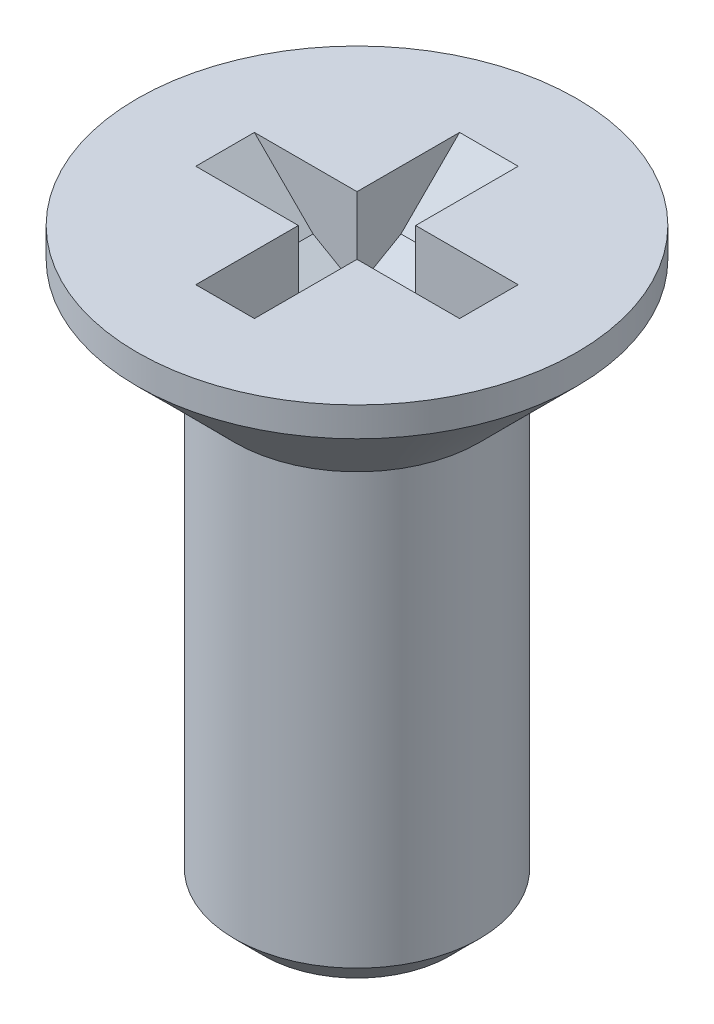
ISO-10303-21;
HEADER;
FILE_DESCRIPTION(('STEP AP214'),'2;1');
FILE_NAME('part.step','',(''),(''),'','','');
FILE_SCHEMA(('AUTOMOTIVE_DESIGN { 1 0 10303 214 1 1 1 1 }'));
ENDSEC;
DATA;
#1=APPLICATION_CONTEXT('core data for automotive mechanical design processes');
#2=APPLICATION_PROTOCOL_DEFINITION('international standard','automotive_design',2000,#1);
#3=PRODUCT_CONTEXT('',#1,'mechanical');
#4=PRODUCT('Part','Part','',(#3));
#5=PRODUCT_RELATED_PRODUCT_CATEGORY('part','',(#4));
#6=PRODUCT_DEFINITION_FORMATION('','',#4);
#7=PRODUCT_DEFINITION_CONTEXT('part definition',#1,'design');
#8=PRODUCT_DEFINITION('design','',#6,#7);
#9=PRODUCT_DEFINITION_SHAPE('','',#8);
#10=(LENGTH_UNIT() NAMED_UNIT(*) SI_UNIT(.MILLI.,.METRE.));
#11=(NAMED_UNIT(*) PLANE_ANGLE_UNIT() SI_UNIT($,.RADIAN.));
#12=(NAMED_UNIT(*) SI_UNIT($,.STERADIAN.) SOLID_ANGLE_UNIT());
#13=UNCERTAINTY_MEASURE_WITH_UNIT(LENGTH_MEASURE(1.E-05),#10,'distance_accuracy_value','');
#14=(GEOMETRIC_REPRESENTATION_CONTEXT(3) GLOBAL_UNCERTAINTY_ASSIGNED_CONTEXT((#13)) GLOBAL_UNIT_ASSIGNED_CONTEXT((#10,
#11,#12)) REPRESENTATION_CONTEXT('',''));
#15=CARTESIAN_POINT('',(0.,0.,0.));
#16=DIRECTION('',(0.,0.,1.));
#17=DIRECTION('',(1.,0.,0.));
#18=AXIS2_PLACEMENT_3D('',#15,#16,#17);
#19=CARTESIAN_POINT('',(-0.3,-0.8598076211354,-0.3));
#20=DIRECTION('',(0.,-1.,0.));
#21=DIRECTION('',(0.,0.,-1.));
#22=AXIS2_PLACEMENT_3D('',#19,#20,#21);
#23=PLANE('',#22);
#24=DIRECTION('',(1.,0.,0.));
#25=VECTOR('',#24,1.);
#26=CARTESIAN_POINT('',(0.3,-0.859807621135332,-0.300000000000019));
#27=LINE('',#26,#25);
#28=CARTESIAN_POINT('',(0.300000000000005,-0.859807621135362,-0.300000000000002));
#29=VERTEX_POINT('',#28);
#30=CARTESIAN_POINT('',(-0.300000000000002,-0.859807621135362,-0.300000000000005));
#31=VERTEX_POINT('',#30);
#32=EDGE_CURVE('E135',#29,#31,#27,.F.);
#33=ORIENTED_EDGE('',*,*,#32,.T.);
#34=DIRECTION('',(0.,0.,1.));
#35=VECTOR('',#34,1.);
#36=CARTESIAN_POINT('',(-0.300000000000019,-0.859807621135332,-0.3));
#37=LINE('',#36,#35);
#38=CARTESIAN_POINT('',(-0.300000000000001,-0.85980762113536,0.300000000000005));
#39=VERTEX_POINT('',#38);
#40=EDGE_CURVE('E116',#31,#39,#37,.T.);
#41=ORIENTED_EDGE('',*,*,#40,.T.);
#42=DIRECTION('',(1.,0.,0.));
#43=VECTOR('',#42,1.);
#44=CARTESIAN_POINT('',(-0.3,-0.859807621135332,0.300000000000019));
#45=LINE('',#44,#43);
#46=CARTESIAN_POINT('',(0.300000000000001,-0.85980762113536,0.300000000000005));
#47=VERTEX_POINT('',#46);
#48=EDGE_CURVE('E112',#39,#47,#45,.T.);
#49=ORIENTED_EDGE('',*,*,#48,.T.);
#50=DIRECTION('',(0.,0.,1.));
#51=VECTOR('',#50,1.);
#52=CARTESIAN_POINT('',(0.300000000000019,-0.859807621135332,0.3));
#53=LINE('',#52,#51);
#54=EDGE_CURVE('E137',#47,#29,#53,.F.);
#55=ORIENTED_EDGE('',*,*,#54,.T.);
#56=EDGE_LOOP('',(#33,#41,#49,#55));
#57=FACE_BOUND('',#56,.T.);
#58=ADVANCED_FACE('F17',(#57),#23,.F.);
#59=CARTESIAN_POINT('',(-0.3,-0.6,0.75));
#60=DIRECTION('',(0.,-0.866025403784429,0.500000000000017));
#61=DIRECTION('',(0.,-0.500000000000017,-0.866025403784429));
#62=AXIS2_PLACEMENT_3D('',#59,#60,#61);
#63=PLANE('',#62);
#64=DIRECTION('',(0.,-0.499999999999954,-0.866025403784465));
#65=VECTOR('',#64,1.);
#66=CARTESIAN_POINT('',(0.3,-0.6,0.75));
#67=LINE('',#66,#65);
#68=CARTESIAN_POINT('',(0.3,-0.6,0.75));
#69=VERTEX_POINT('',#68);
#70=EDGE_CURVE('E130',#69,#47,#67,.T.);
#71=ORIENTED_EDGE('',*,*,#70,.T.);
#72=ORIENTED_EDGE('',*,*,#48,.F.);
#73=DIRECTION('',(0.,-0.499999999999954,-0.866025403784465));
#74=VECTOR('',#73,1.);
#75=CARTESIAN_POINT('',(-0.3,-0.6,0.75));
#76=LINE('',#75,#74);
#77=CARTESIAN_POINT('',(-0.3,-0.6,0.75));
#78=VERTEX_POINT('',#77);
#79=EDGE_CURVE('E109',#78,#39,#76,.T.);
#80=ORIENTED_EDGE('',*,*,#79,.F.);
#81=DIRECTION('',(1.,0.,0.));
#82=VECTOR('',#81,1.);
#83=CARTESIAN_POINT('',(-0.3,-0.6,0.75));
#84=LINE('',#83,#82);
#85=EDGE_CURVE('E105',#78,#69,#84,.T.);
#86=ORIENTED_EDGE('',*,*,#85,.T.);
#87=EDGE_LOOP('',(#71,#72,#80,#86));
#88=FACE_BOUND('',#87,.T.);
#89=ADVANCED_FACE('F111',(#88),#63,.F.);
#90=CARTESIAN_POINT('',(0.75,-0.6,0.3));
#91=DIRECTION('',(0.500000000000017,-0.866025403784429,0.));
#92=DIRECTION('',(0.866025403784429,0.500000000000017,0.));
#93=AXIS2_PLACEMENT_3D('',#90,#91,#92);
#94=PLANE('',#93);
#95=DIRECTION('',(-0.866025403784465,-0.499999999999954,0.));
#96=VECTOR('',#95,1.);
#97=CARTESIAN_POINT('',(0.75,-0.6,-0.3));
#98=LINE('',#97,#96);
#99=CARTESIAN_POINT('',(0.75,-0.6,-0.3));
#100=VERTEX_POINT('',#99);
#101=EDGE_CURVE('E424',#100,#29,#98,.T.);
#102=ORIENTED_EDGE('',*,*,#101,.T.);
#103=ORIENTED_EDGE('',*,*,#54,.F.);
#104=DIRECTION('',(0.866025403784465,0.499999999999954,0.));
#105=VECTOR('',#104,1.);
#106=CARTESIAN_POINT('',(0.3,-0.8598076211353,0.3));
#107=LINE('',#106,#105);
#108=CARTESIAN_POINT('',(0.75,-0.6,0.3));
#109=VERTEX_POINT('',#108);
#110=EDGE_CURVE('E434',#47,#109,#107,.T.);
#111=ORIENTED_EDGE('',*,*,#110,.T.);
#112=DIRECTION('',(0.,0.,1.));
#113=VECTOR('',#112,1.);
#114=CARTESIAN_POINT('',(0.75,-0.6,0.3));
#115=LINE('',#114,#113);
#116=EDGE_CURVE('E429',#109,#100,#115,.F.);
#117=ORIENTED_EDGE('',*,*,#116,.T.);
#118=EDGE_LOOP('',(#102,#103,#111,#117));
#119=FACE_BOUND('',#118,.T.);
#120=ADVANCED_FACE('F339',(#119),#94,.F.);
#121=CARTESIAN_POINT('',(0.3,-0.6,-0.75));
#122=DIRECTION('',(0.,-0.866025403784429,-0.500000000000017));
#123=DIRECTION('',(0.,0.500000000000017,-0.866025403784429));
#124=AXIS2_PLACEMENT_3D('',#121,#122,#123);
#125=PLANE('',#124);
#126=DIRECTION('',(0.,-0.499999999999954,0.866025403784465));
#127=VECTOR('',#126,1.);
#128=CARTESIAN_POINT('',(-0.3,-0.6,-0.75));
#129=LINE('',#128,#127);
#130=CARTESIAN_POINT('',(-0.3,-0.6,-0.75));
#131=VERTEX_POINT('',#130);
#132=EDGE_CURVE('E388',#131,#31,#129,.T.);
#133=ORIENTED_EDGE('',*,*,#132,.T.);
#134=ORIENTED_EDGE('',*,*,#32,.F.);
#135=DIRECTION('',(0.,-0.499999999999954,0.866025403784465));
#136=VECTOR('',#135,1.);
#137=CARTESIAN_POINT('',(0.3,-0.6,-0.75));
#138=LINE('',#137,#136);
#139=CARTESIAN_POINT('',(0.3,-0.6,-0.75));
#140=VERTEX_POINT('',#139);
#141=EDGE_CURVE('E421',#140,#29,#138,.T.);
#142=ORIENTED_EDGE('',*,*,#141,.F.);
#143=DIRECTION('',(1.,0.,0.));
#144=VECTOR('',#143,1.);
#145=CARTESIAN_POINT('',(0.3,-0.6,-0.75));
#146=LINE('',#145,#144);
#147=EDGE_CURVE('E390',#140,#131,#146,.F.);
#148=ORIENTED_EDGE('',*,*,#147,.T.);
#149=EDGE_LOOP('',(#133,#134,#142,#148));
#150=FACE_BOUND('',#149,.T.);
#151=ADVANCED_FACE('F330',(#150),#125,.F.);
#152=CARTESIAN_POINT('',(-0.75,-0.6,-0.3));
#153=DIRECTION('',(-0.500000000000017,-0.866025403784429,0.));
#154=DIRECTION('',(0.866025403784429,-0.500000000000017,0.));
#155=AXIS2_PLACEMENT_3D('',#152,#153,#154);
#156=PLANE('',#155);
#157=DIRECTION('',(0.866025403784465,-0.499999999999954,0.));
#158=VECTOR('',#157,1.);
#159=CARTESIAN_POINT('',(-0.75,-0.6,-0.3));
#160=LINE('',#159,#158);
#161=CARTESIAN_POINT('',(-0.75,-0.6,-0.3));
#162=VERTEX_POINT('',#161);
#163=EDGE_CURVE('E394',#162,#31,#160,.T.);
#164=ORIENTED_EDGE('',*,*,#163,.F.);
#165=DIRECTION('',(0.,0.,1.));
#166=VECTOR('',#165,1.);
#167=CARTESIAN_POINT('',(-0.75,-0.6,-0.3));
#168=LINE('',#167,#166);
#169=CARTESIAN_POINT('',(-0.75,-0.6,0.3));
#170=VERTEX_POINT('',#169);
#171=EDGE_CURVE('E477',#162,#170,#168,.T.);
#172=ORIENTED_EDGE('',*,*,#171,.T.);
#173=DIRECTION('',(0.866025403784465,-0.499999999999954,0.));
#174=VECTOR('',#173,1.);
#175=CARTESIAN_POINT('',(-0.75,-0.6,0.3));
#176=LINE('',#175,#174);
#177=EDGE_CURVE('E400',#170,#39,#176,.T.);
#178=ORIENTED_EDGE('',*,*,#177,.T.);
#179=ORIENTED_EDGE('',*,*,#40,.F.);
#180=EDGE_LOOP('',(#164,#172,#178,#179));
#181=FACE_BOUND('',#180,.T.);
#182=ADVANCED_FACE('F322',(#181),#156,.F.);
#183=CARTESIAN_POINT('',(-0.3,0.,0.));
#184=DIRECTION('',(1.,0.,0.));
#185=DIRECTION('',(0.,0.,-1.));
#186=AXIS2_PLACEMENT_3D('',#183,#184,#185);
#187=PLANE('',#186);
#188=DIRECTION('',(0.,1.,0.));
#189=VECTOR('',#188,1.);
#190=CARTESIAN_POINT('',(-0.3,0.,0.3));
#191=LINE('',#190,#189);
#192=CARTESIAN_POINT('',(-0.3,0.,0.3));
#193=VERTEX_POINT('',#192);
#194=EDGE_CURVE('E475',#39,#193,#191,.T.);
#195=ORIENTED_EDGE('',*,*,#194,.T.);
#196=DIRECTION('',(0.,0.,-1.));
#197=VECTOR('',#196,1.);
#198=CARTESIAN_POINT('',(-0.3,0.,0.));
#199=LINE('',#198,#197);
#200=CARTESIAN_POINT('',(-0.3,0.,1.35));
#201=VERTEX_POINT('',#200);
#202=EDGE_CURVE('E121',#193,#201,#199,.F.);
#203=ORIENTED_EDGE('',*,*,#202,.T.);
#204=DIRECTION('',(0.,-0.707106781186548,-0.707106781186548));
#205=VECTOR('',#204,1.);
#206=CARTESIAN_POINT('',(-0.3,0.,1.35));
#207=LINE('',#206,#205);
#208=EDGE_CURVE('E115',#201,#78,#207,.T.);
#209=ORIENTED_EDGE('',*,*,#208,.T.);
#210=ORIENTED_EDGE('',*,*,#79,.T.);
#211=EDGE_LOOP('',(#195,#203,#209,#210));
#212=FACE_BOUND('',#211,.T.);
#213=ADVANCED_FACE('F119',(#212),#187,.T.);
#214=CARTESIAN_POINT('',(-0.3,0.,1.35));
#215=DIRECTION('',(0.,-0.707106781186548,0.707106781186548));
#216=DIRECTION('',(0.,-0.707106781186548,-0.707106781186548));
#217=AXIS2_PLACEMENT_3D('',#214,#215,#216);
#218=PLANE('',#217);
#219=ORIENTED_EDGE('',*,*,#85,.F.);
#220=ORIENTED_EDGE('',*,*,#208,.F.);
#221=DIRECTION('',(1.,0.,0.));
#222=VECTOR('',#221,1.);
#223=CARTESIAN_POINT('',(0.,0.,1.35));
#224=LINE('',#223,#222);
#225=CARTESIAN_POINT('',(0.3,0.,1.35));
#226=VERTEX_POINT('',#225);
#227=EDGE_CURVE('E469',#201,#226,#224,.T.);
#228=ORIENTED_EDGE('',*,*,#227,.T.);
#229=DIRECTION('',(0.,-0.707106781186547,-0.707106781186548));
#230=VECTOR('',#229,1.);
#231=CARTESIAN_POINT('',(0.3,0.,1.35));
#232=LINE('',#231,#230);
#233=EDGE_CURVE('E127',#226,#69,#232,.T.);
#234=ORIENTED_EDGE('',*,*,#233,.T.);
#235=EDGE_LOOP('',(#219,#220,#228,#234));
#236=FACE_BOUND('',#235,.T.);
#237=ADVANCED_FACE('F125',(#236),#218,.F.);
#238=CARTESIAN_POINT('',(0.3,0.,0.));
#239=DIRECTION('',(1.,0.,0.));
#240=DIRECTION('',(0.,0.,-1.));
#241=AXIS2_PLACEMENT_3D('',#238,#239,#240);
#242=PLANE('',#241);
#243=ORIENTED_EDGE('',*,*,#70,.F.);
#244=ORIENTED_EDGE('',*,*,#233,.F.);
#245=DIRECTION('',(0.,0.,-1.));
#246=VECTOR('',#245,1.);
#247=CARTESIAN_POINT('',(0.3,0.,0.));
#248=LINE('',#247,#246);
#249=CARTESIAN_POINT('',(0.3,0.,0.3));
#250=VERTEX_POINT('',#249);
#251=EDGE_CURVE('E440',#226,#250,#248,.T.);
#252=ORIENTED_EDGE('',*,*,#251,.T.);
#253=DIRECTION('',(0.,1.,0.));
#254=VECTOR('',#253,1.);
#255=CARTESIAN_POINT('',(0.3,0.,0.3));
#256=LINE('',#255,#254);
#257=EDGE_CURVE('E436',#250,#47,#256,.F.);
#258=ORIENTED_EDGE('',*,*,#257,.T.);
#259=EDGE_LOOP('',(#243,#244,#252,#258));
#260=FACE_BOUND('',#259,.T.);
#261=ADVANCED_FACE('F298',(#260),#242,.F.);
#262=CARTESIAN_POINT('',(0.,0.,0.3));
#263=DIRECTION('',(0.,0.,1.));
#264=DIRECTION('',(1.,0.,0.));
#265=AXIS2_PLACEMENT_3D('',#262,#263,#264);
#266=PLANE('',#265);
#267=DIRECTION('',(0.707106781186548,0.707106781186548,0.));
#268=VECTOR('',#267,1.);
#269=CARTESIAN_POINT('',(1.35,0.,0.3));
#270=LINE('',#269,#268);
#271=CARTESIAN_POINT('',(1.35,0.,0.3));
#272=VERTEX_POINT('',#271);
#273=EDGE_CURVE('E431',#272,#109,#270,.F.);
#274=ORIENTED_EDGE('',*,*,#273,.T.);
#275=ORIENTED_EDGE('',*,*,#110,.F.);
#276=ORIENTED_EDGE('',*,*,#257,.F.);
#277=DIRECTION('',(1.,0.,0.));
#278=VECTOR('',#277,1.);
#279=CARTESIAN_POINT('',(0.,0.,0.3));
#280=LINE('',#279,#278);
#281=EDGE_CURVE('E446',#250,#272,#280,.T.);
#282=ORIENTED_EDGE('',*,*,#281,.T.);
#283=EDGE_LOOP('',(#274,#275,#276,#282));
#284=FACE_BOUND('',#283,.T.);
#285=ADVANCED_FACE('F289',(#284),#266,.F.);
#286=CARTESIAN_POINT('',(1.35,0.,0.3));
#287=DIRECTION('',(0.707106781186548,-0.707106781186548,0.));
#288=DIRECTION('',(0.707106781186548,0.707106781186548,0.));
#289=AXIS2_PLACEMENT_3D('',#286,#287,#288);
#290=PLANE('',#289);
#291=ORIENTED_EDGE('',*,*,#116,.F.);
#292=ORIENTED_EDGE('',*,*,#273,.F.);
#293=DIRECTION('',(0.,0.,-1.));
#294=VECTOR('',#293,1.);
#295=CARTESIAN_POINT('',(1.35,0.,0.));
#296=LINE('',#295,#294);
#297=CARTESIAN_POINT('',(1.35,0.,-0.3));
#298=VERTEX_POINT('',#297);
#299=EDGE_CURVE('E449',#272,#298,#296,.T.);
#300=ORIENTED_EDGE('',*,*,#299,.T.);
#301=DIRECTION('',(-0.707106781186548,-0.707106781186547,0.));
#302=VECTOR('',#301,1.);
#303=CARTESIAN_POINT('',(1.35,0.,-0.3));
#304=LINE('',#303,#302);
#305=EDGE_CURVE('E426',#298,#100,#304,.T.);
#306=ORIENTED_EDGE('',*,*,#305,.T.);
#307=EDGE_LOOP('',(#291,#292,#300,#306));
#308=FACE_BOUND('',#307,.T.);
#309=ADVANCED_FACE('F280',(#308),#290,.F.);
#310=CARTESIAN_POINT('',(0.,0.,-0.3));
#311=DIRECTION('',(0.,0.,-1.));
#312=DIRECTION('',(-1.,0.,0.));
#313=AXIS2_PLACEMENT_3D('',#310,#311,#312);
#314=PLANE('',#313);
#315=ORIENTED_EDGE('',*,*,#101,.F.);
#316=ORIENTED_EDGE('',*,*,#305,.F.);
#317=DIRECTION('',(1.,0.,0.));
#318=VECTOR('',#317,1.);
#319=CARTESIAN_POINT('',(0.,0.,-0.3));
#320=LINE('',#319,#318);
#321=CARTESIAN_POINT('',(0.3,0.,-0.3));
#322=VERTEX_POINT('',#321);
#323=EDGE_CURVE('E451',#298,#322,#320,.F.);
#324=ORIENTED_EDGE('',*,*,#323,.T.);
#325=DIRECTION('',(0.,1.,0.));
#326=VECTOR('',#325,1.);
#327=CARTESIAN_POINT('',(0.3,0.,-0.3));
#328=LINE('',#327,#326);
#329=EDGE_CURVE('E418',#29,#322,#328,.T.);
#330=ORIENTED_EDGE('',*,*,#329,.F.);
#331=EDGE_LOOP('',(#315,#316,#324,#330));
#332=FACE_BOUND('',#331,.T.);
#333=ADVANCED_FACE('F271',(#332),#314,.F.);
#334=CARTESIAN_POINT('',(0.3,0.,0.));
#335=DIRECTION('',(-1.,0.,0.));
#336=DIRECTION('',(0.,0.,1.));
#337=AXIS2_PLACEMENT_3D('',#334,#335,#336);
#338=PLANE('',#337);
#339=ORIENTED_EDGE('',*,*,#141,.T.);
#340=ORIENTED_EDGE('',*,*,#329,.T.);
#341=DIRECTION('',(0.,0.,-1.));
#342=VECTOR('',#341,1.);
#343=CARTESIAN_POINT('',(0.3,0.,0.));
#344=LINE('',#343,#342);
#345=CARTESIAN_POINT('',(0.3,0.,-1.35));
#346=VERTEX_POINT('',#345);
#347=EDGE_CURVE('E454',#322,#346,#344,.T.);
#348=ORIENTED_EDGE('',*,*,#347,.T.);
#349=DIRECTION('',(0.,0.707106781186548,-0.707106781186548));
#350=VECTOR('',#349,1.);
#351=CARTESIAN_POINT('',(0.3,0.,-1.35));
#352=LINE('',#351,#350);
#353=EDGE_CURVE('E415',#346,#140,#352,.F.);
#354=ORIENTED_EDGE('',*,*,#353,.T.);
#355=EDGE_LOOP('',(#339,#340,#348,#354));
#356=FACE_BOUND('',#355,.T.);
#357=ADVANCED_FACE('F262',(#356),#338,.T.);
#358=CARTESIAN_POINT('',(0.3,0.,-1.35));
#359=DIRECTION('',(0.,-0.707106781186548,-0.707106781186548));
#360=DIRECTION('',(0.,0.707106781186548,-0.707106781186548));
#361=AXIS2_PLACEMENT_3D('',#358,#359,#360);
#362=PLANE('',#361);
#363=ORIENTED_EDGE('',*,*,#147,.F.);
#364=ORIENTED_EDGE('',*,*,#353,.F.);
#365=DIRECTION('',(1.,0.,0.));
#366=VECTOR('',#365,1.);
#367=CARTESIAN_POINT('',(0.,0.,-1.35));
#368=LINE('',#367,#366);
#369=CARTESIAN_POINT('',(-0.3,0.,-1.35));
#370=VERTEX_POINT('',#369);
#371=EDGE_CURVE('E456',#346,#370,#368,.F.);
#372=ORIENTED_EDGE('',*,*,#371,.T.);
#373=DIRECTION('',(0.,-0.707106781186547,0.707106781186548));
#374=VECTOR('',#373,1.);
#375=CARTESIAN_POINT('',(-0.3,0.,-1.35));
#376=LINE('',#375,#374);
#377=EDGE_CURVE('E395',#370,#131,#376,.T.);
#378=ORIENTED_EDGE('',*,*,#377,.T.);
#379=EDGE_LOOP('',(#363,#364,#372,#378));
#380=FACE_BOUND('',#379,.T.);
#381=ADVANCED_FACE('F253',(#380),#362,.F.);
#382=CARTESIAN_POINT('',(-0.3,0.,0.));
#383=DIRECTION('',(-1.,0.,0.));
#384=DIRECTION('',(0.,0.,1.));
#385=AXIS2_PLACEMENT_3D('',#382,#383,#384);
#386=PLANE('',#385);
#387=ORIENTED_EDGE('',*,*,#132,.F.);
#388=ORIENTED_EDGE('',*,*,#377,.F.);
#389=DIRECTION('',(0.,0.,-1.));
#390=VECTOR('',#389,1.);
#391=CARTESIAN_POINT('',(-0.3,0.,0.));
#392=LINE('',#391,#390);
#393=CARTESIAN_POINT('',(-0.3,0.,-0.3));
#394=VERTEX_POINT('',#393);
#395=EDGE_CURVE('E405',#370,#394,#392,.F.);
#396=ORIENTED_EDGE('',*,*,#395,.T.);
#397=DIRECTION('',(0.,1.,0.));
#398=VECTOR('',#397,1.);
#399=CARTESIAN_POINT('',(-0.3,0.,-0.3));
#400=LINE('',#399,#398);
#401=EDGE_CURVE('E403',#31,#394,#400,.T.);
#402=ORIENTED_EDGE('',*,*,#401,.F.);
#403=EDGE_LOOP('',(#387,#388,#396,#402));
#404=FACE_BOUND('',#403,.T.);
#405=ADVANCED_FACE('F244',(#404),#386,.F.);
#406=CARTESIAN_POINT('',(0.,0.,-0.3));
#407=DIRECTION('',(0.,0.,1.));
#408=DIRECTION('',(1.,0.,0.));
#409=AXIS2_PLACEMENT_3D('',#406,#407,#408);
#410=PLANE('',#409);
#411=ORIENTED_EDGE('',*,*,#163,.T.);
#412=ORIENTED_EDGE('',*,*,#401,.T.);
#413=DIRECTION('',(1.,0.,0.));
#414=VECTOR('',#413,1.);
#415=CARTESIAN_POINT('',(0.,0.,-0.3));
#416=LINE('',#415,#414);
#417=CARTESIAN_POINT('',(-1.35,0.,-0.3));
#418=VERTEX_POINT('',#417);
#419=EDGE_CURVE('E458',#394,#418,#416,.F.);
#420=ORIENTED_EDGE('',*,*,#419,.T.);
#421=DIRECTION('',(0.707106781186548,-0.707106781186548,0.));
#422=VECTOR('',#421,1.);
#423=CARTESIAN_POINT('',(-1.35,0.,-0.3));
#424=LINE('',#423,#422);
#425=EDGE_CURVE('E407',#418,#162,#424,.T.);
#426=ORIENTED_EDGE('',*,*,#425,.T.);
#427=EDGE_LOOP('',(#411,#412,#420,#426));
#428=FACE_BOUND('',#427,.T.);
#429=ADVANCED_FACE('F236',(#428),#410,.T.);
#430=CARTESIAN_POINT('',(-1.35,0.,-0.3));
#431=DIRECTION('',(-0.707106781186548,-0.707106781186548,0.));
#432=DIRECTION('',(0.707106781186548,-0.707106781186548,0.));
#433=AXIS2_PLACEMENT_3D('',#430,#431,#432);
#434=PLANE('',#433);
#435=ORIENTED_EDGE('',*,*,#171,.F.);
#436=ORIENTED_EDGE('',*,*,#425,.F.);
#437=DIRECTION('',(0.,0.,-1.));
#438=VECTOR('',#437,1.);
#439=CARTESIAN_POINT('',(-1.35,0.,0.));
#440=LINE('',#439,#438);
#441=CARTESIAN_POINT('',(-1.35,0.,0.3));
#442=VERTEX_POINT('',#441);
#443=EDGE_CURVE('E35',#418,#442,#440,.F.);
#444=ORIENTED_EDGE('',*,*,#443,.T.);
#445=DIRECTION('',(0.707106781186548,-0.707106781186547,0.));
#446=VECTOR('',#445,1.);
#447=CARTESIAN_POINT('',(-1.35,0.,0.3));
#448=LINE('',#447,#446);
#449=EDGE_CURVE('E473',#442,#170,#448,.T.);
#450=ORIENTED_EDGE('',*,*,#449,.T.);
#451=EDGE_LOOP('',(#435,#436,#444,#450));
#452=FACE_BOUND('',#451,.T.);
#453=ADVANCED_FACE('F227',(#452),#434,.F.);
#454=CARTESIAN_POINT('',(0.,0.,0.3));
#455=DIRECTION('',(0.,0.,1.));
#456=DIRECTION('',(1.,0.,0.));
#457=AXIS2_PLACEMENT_3D('',#454,#455,#456);
#458=PLANE('',#457);
#459=ORIENTED_EDGE('',*,*,#449,.F.);
#460=DIRECTION('',(1.,0.,0.));
#461=VECTOR('',#460,1.);
#462=CARTESIAN_POINT('',(0.,0.,0.3));
#463=LINE('',#462,#461);
#464=EDGE_CURVE('E146',#442,#193,#463,.T.);
#465=ORIENTED_EDGE('',*,*,#464,.T.);
#466=ORIENTED_EDGE('',*,*,#194,.F.);
#467=ORIENTED_EDGE('',*,*,#177,.F.);
#468=EDGE_LOOP('',(#459,#465,#466,#467));
#469=FACE_BOUND('',#468,.T.);
#470=ADVANCED_FACE('F166',(#469),#458,.F.);
#471=CARTESIAN_POINT('',(0.,0.,0.));
#472=DIRECTION('',(0.,-1.,0.));
#473=DIRECTION('',(0.,0.,-1.));
#474=AXIS2_PLACEMENT_3D('',#471,#472,#473);
#475=PLANE('',#474);
#476=ORIENTED_EDGE('',*,*,#443,.F.);
#477=ORIENTED_EDGE('',*,*,#419,.F.);
#478=ORIENTED_EDGE('',*,*,#395,.F.);
#479=ORIENTED_EDGE('',*,*,#371,.F.);
#480=ORIENTED_EDGE('',*,*,#347,.F.);
#481=ORIENTED_EDGE('',*,*,#323,.F.);
#482=ORIENTED_EDGE('',*,*,#299,.F.);
#483=ORIENTED_EDGE('',*,*,#281,.F.);
#484=ORIENTED_EDGE('',*,*,#251,.F.);
#485=ORIENTED_EDGE('',*,*,#227,.F.);
#486=ORIENTED_EDGE('',*,*,#202,.F.);
#487=ORIENTED_EDGE('',*,*,#464,.F.);
#488=EDGE_LOOP('',(#476,#477,#478,#479,#480,#481,#482,#483,#484,#485,#486,#487));
#489=FACE_BOUND('',#488,.T.);
#490=CARTESIAN_POINT('',(0.,0.,0.));
#491=DIRECTION('',(0.,-1.,0.));
#492=DIRECTION('',(0.,0.,-1.));
#493=AXIS2_PLACEMENT_3D('',#490,#491,#492);
#494=CIRCLE('',#493,2.25);
#495=CARTESIAN_POINT('',(0.,0.,-2.25));
#496=VERTEX_POINT('',#495);
#497=EDGE_CURVE('E144',#496,#496,#494,.T.);
#498=ORIENTED_EDGE('',*,*,#497,.F.);
#499=EDGE_LOOP('',(#498));
#500=FACE_BOUND('',#499,.T.);
#501=ADVANCED_FACE('F156',(#489,#500),#475,.F.);
#502=CARTESIAN_POINT('',(0.,0.795,0.));
#503=DIRECTION('',(0.,-1.,0.));
#504=DIRECTION('',(0.,0.,-1.));
#505=AXIS2_PLACEMENT_3D('',#502,#503,#504);
#506=CYLINDRICAL_SURFACE('',#505,2.25);
#507=ORIENTED_EDGE('',*,*,#497,.T.);
#508=EDGE_LOOP('',(#507));
#509=FACE_BOUND('',#508,.T.);
#510=CARTESIAN_POINT('',(0.,-0.299999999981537,0.));
#511=DIRECTION('',(0.,1.,0.));
#512=DIRECTION('',(0.,0.,-1.));
#513=AXIS2_PLACEMENT_3D('',#510,#511,#512);
#514=CIRCLE('',#513,2.25000000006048);
#515=CARTESIAN_POINT('',(0.,-0.299999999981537,-2.25000000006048));
#516=VERTEX_POINT('',#515);
#517=EDGE_CURVE('E143',#516,#516,#514,.F.);
#518=ORIENTED_EDGE('',*,*,#517,.F.);
#519=EDGE_LOOP('',(#518));
#520=FACE_BOUND('',#519,.T.);
#521=ADVANCED_FACE('F153',(#509,#520),#506,.T.);
#522=CARTESIAN_POINT('',(0.,-6.,0.));
#523=DIRECTION('',(0.,-1.,0.));
#524=DIRECTION('',(0.,0.,-1.));
#525=AXIS2_PLACEMENT_3D('',#522,#523,#524);
#526=PLANE('',#525);
#527=CARTESIAN_POINT('',(0.,-5.99999999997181,0.));
#528=DIRECTION('',(0.,1.,0.));
#529=DIRECTION('',(0.,0.,1.));
#530=AXIS2_PLACEMENT_3D('',#527,#528,#529);
#531=CIRCLE('',#530,0.949999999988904);
#532=CARTESIAN_POINT('',(0.,-5.99999999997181,0.949999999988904));
#533=VERTEX_POINT('',#532);
#534=EDGE_CURVE('E140',#533,#533,#531,.T.);
#535=ORIENTED_EDGE('',*,*,#534,.F.);
#536=EDGE_LOOP('',(#535));
#537=FACE_BOUND('',#536,.T.);
#538=ADVANCED_FACE('F155',(#537),#526,.T.);
#539=CARTESIAN_POINT('',(0.,-0.300000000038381,0.));
#540=DIRECTION('',(0.,1.,0.));
#541=DIRECTION('',(0.,0.,1.));
#542=AXIS2_PLACEMENT_3D('',#539,#540,#541);
#543=CONICAL_SURFACE('',#542,2.25000000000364,0.785398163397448);
#544=ORIENTED_EDGE('',*,*,#517,.T.);
#545=EDGE_LOOP('',(#544));
#546=FACE_BOUND('',#545,.T.);
#547=CARTESIAN_POINT('',(0.,-1.3,0.));
#548=DIRECTION('',(0.,-1.,0.));
#549=DIRECTION('',(0.,0.,-1.));
#550=AXIS2_PLACEMENT_3D('',#547,#548,#549);
#551=CIRCLE('',#550,1.25);
#552=CARTESIAN_POINT('',(0.,-1.3,-1.25));
#553=VERTEX_POINT('',#552);
#554=EDGE_CURVE('E26',#553,#553,#551,.T.);
#555=ORIENTED_EDGE('',*,*,#554,.F.);
#556=EDGE_LOOP('',(#555));
#557=FACE_BOUND('',#556,.T.);
#558=ADVANCED_FACE('F150',(#546,#557),#543,.T.);
#559=CARTESIAN_POINT('',(0.,-5.7000000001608,0.));
#560=DIRECTION('',(0.,1.,0.));
#561=DIRECTION('',(0.,0.,1.));
#562=AXIS2_PLACEMENT_3D('',#559,#560,#561);
#563=CONICAL_SURFACE('',#562,1.24999999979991,0.785398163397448);
#564=ORIENTED_EDGE('',*,*,#534,.T.);
#565=EDGE_LOOP('',(#564));
#566=FACE_BOUND('',#565,.T.);
#567=CARTESIAN_POINT('',(0.,-5.7,0.));
#568=DIRECTION('',(0.,-1.,0.));
#569=DIRECTION('',(0.,0.,-1.));
#570=AXIS2_PLACEMENT_3D('',#567,#568,#569);
#571=CIRCLE('',#570,1.25);
#572=CARTESIAN_POINT('',(0.,-5.7,-1.25));
#573=VERTEX_POINT('',#572);
#574=EDGE_CURVE('E11',#573,#573,#571,.F.);
#575=ORIENTED_EDGE('',*,*,#574,.F.);
#576=EDGE_LOOP('',(#575));
#577=FACE_BOUND('',#576,.T.);
#578=ADVANCED_FACE('F171',(#566,#577),#563,.T.);
#579=CARTESIAN_POINT('',(0.,0.795,0.));
#580=DIRECTION('',(0.,-1.,0.));
#581=DIRECTION('',(0.,0.,-1.));
#582=AXIS2_PLACEMENT_3D('',#579,#580,#581);
#583=CYLINDRICAL_SURFACE('',#582,1.25);
#584=ORIENTED_EDGE('',*,*,#554,.T.);
#585=EDGE_LOOP('',(#584));
#586=FACE_BOUND('',#585,.T.);
#587=ORIENTED_EDGE('',*,*,#574,.T.);
#588=EDGE_LOOP('',(#587));
#589=FACE_BOUND('',#588,.T.);
#590=ADVANCED_FACE('F169',(#586,#589),#583,.T.);
#591=CLOSED_SHELL('',(#58,#89,#120,#151,#182,#213,#237,#261,#285,#309,#333,#357,#381,#405,#429,
#453,#470,#501,#521,#538,#558,#578,#590));
#592=MANIFOLD_SOLID_BREP('B1',#591);
#593=ADVANCED_BREP_SHAPE_REPRESENTATION('',(#18,#592),#14);
#594=SHAPE_DEFINITION_REPRESENTATION(#9,#593);
ENDSEC;
END-ISO-10303-21;
